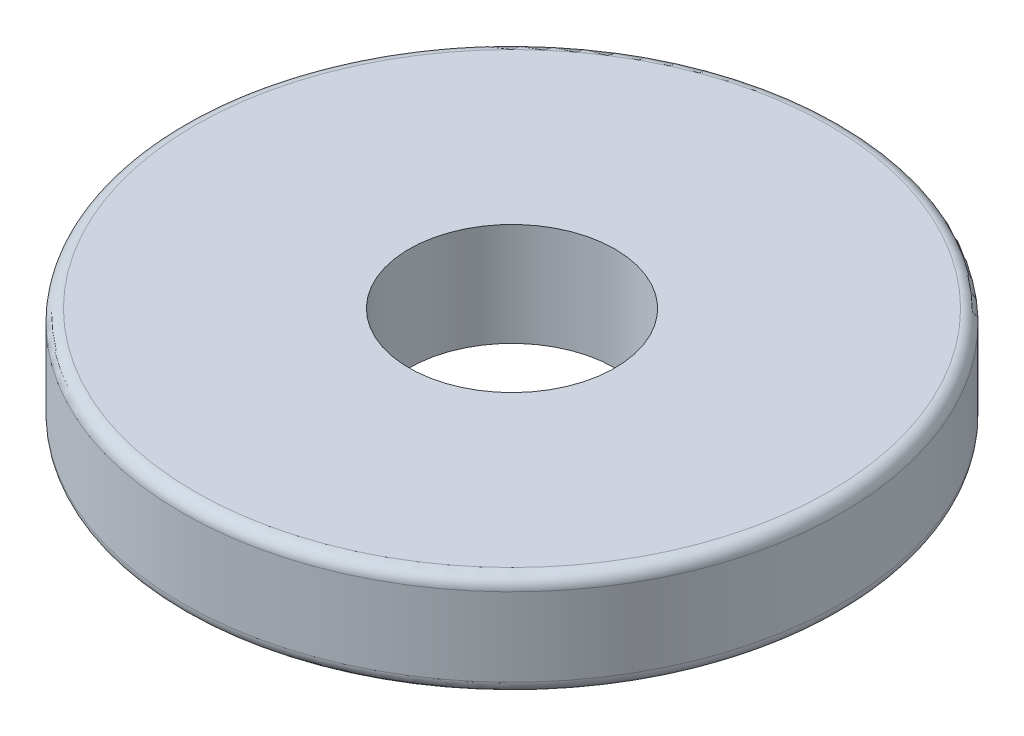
ISO-10303-21;
HEADER;
FILE_DESCRIPTION(('STEP AP214'),'2;1');
FILE_NAME('part.step','',(''),(''),'','','');
FILE_SCHEMA(('AUTOMOTIVE_DESIGN { 1 0 10303 214 1 1 1 1 }'));
ENDSEC;
DATA;
#1=APPLICATION_CONTEXT('core data for automotive mechanical design processes');
#2=APPLICATION_PROTOCOL_DEFINITION('international standard','automotive_design',2000,#1);
#3=PRODUCT_CONTEXT('',#1,'mechanical');
#4=PRODUCT('Part','Part','',(#3));
#5=PRODUCT_RELATED_PRODUCT_CATEGORY('part','',(#4));
#6=PRODUCT_DEFINITION_FORMATION('','',#4);
#7=PRODUCT_DEFINITION_CONTEXT('part definition',#1,'design');
#8=PRODUCT_DEFINITION('design','',#6,#7);
#9=PRODUCT_DEFINITION_SHAPE('','',#8);
#10=(LENGTH_UNIT() NAMED_UNIT(*) SI_UNIT(.MILLI.,.METRE.));
#11=(NAMED_UNIT(*) PLANE_ANGLE_UNIT() SI_UNIT($,.RADIAN.));
#12=(NAMED_UNIT(*) SI_UNIT($,.STERADIAN.) SOLID_ANGLE_UNIT());
#13=UNCERTAINTY_MEASURE_WITH_UNIT(LENGTH_MEASURE(1.E-05),#10,'distance_accuracy_value','');
#14=(GEOMETRIC_REPRESENTATION_CONTEXT(3) GLOBAL_UNCERTAINTY_ASSIGNED_CONTEXT((#13)) GLOBAL_UNIT_ASSIGNED_CONTEXT((#10,
#11,#12)) REPRESENTATION_CONTEXT('',''));
#15=CARTESIAN_POINT('',(0.,0.,0.));
#16=DIRECTION('',(0.,0.,1.));
#17=DIRECTION('',(1.,0.,0.));
#18=AXIS2_PLACEMENT_3D('',#15,#16,#17);
#19=CARTESIAN_POINT('',(0.,0.,0.));
#20=DIRECTION('',(0.,-1.,0.));
#21=DIRECTION('',(0.,0.,-1.));
#22=AXIS2_PLACEMENT_3D('',#19,#20,#21);
#23=CYLINDRICAL_SURFACE('',#22,2.5);
#24=CARTESIAN_POINT('',(0.,1.,0.));
#25=DIRECTION('',(0.,-1.,0.));
#26=DIRECTION('',(0.,0.,-1.));
#27=AXIS2_PLACEMENT_3D('',#24,#25,#26);
#28=CIRCLE('',#27,2.5);
#29=CARTESIAN_POINT('',(0.,1.,-2.5));
#30=VERTEX_POINT('',#29);
#31=EDGE_CURVE('E52',#30,#30,#28,.T.);
#32=ORIENTED_EDGE('',*,*,#31,.T.);
#33=EDGE_LOOP('',(#32));
#34=FACE_BOUND('',#33,.T.);
#35=CARTESIAN_POINT('',(0.,3.5,0.));
#36=DIRECTION('',(0.,-1.,0.));
#37=DIRECTION('',(0.,0.,-1.));
#38=AXIS2_PLACEMENT_3D('',#35,#36,#37);
#39=CIRCLE('',#38,2.5);
#40=CARTESIAN_POINT('',(0.,3.5,-2.5));
#41=VERTEX_POINT('',#40);
#42=EDGE_CURVE('E49',#41,#41,#39,.T.);
#43=ORIENTED_EDGE('',*,*,#42,.F.);
#44=EDGE_LOOP('',(#43));
#45=FACE_BOUND('',#44,.T.);
#46=ADVANCED_FACE('F29',(#34,#45),#23,.F.);
#47=CARTESIAN_POINT('',(2.5,3.5,0.));
#48=DIRECTION('',(0.,1.,0.));
#49=DIRECTION('',(0.,0.,1.));
#50=AXIS2_PLACEMENT_3D('',#47,#48,#49);
#51=PLANE('',#50);
#52=CARTESIAN_POINT('',(0.,3.5,0.));
#53=DIRECTION('',(0.,1.,0.));
#54=DIRECTION('',(0.,0.,1.));
#55=AXIS2_PLACEMENT_3D('',#52,#53,#54);
#56=CIRCLE('',#55,7.7);
#57=CARTESIAN_POINT('',(0.,3.5,7.7));
#58=VERTEX_POINT('',#57);
#59=EDGE_CURVE('E10',#58,#58,#56,.T.);
#60=ORIENTED_EDGE('',*,*,#59,.T.);
#61=EDGE_LOOP('',(#60));
#62=FACE_BOUND('',#61,.T.);
#63=ORIENTED_EDGE('',*,*,#42,.T.);
#64=EDGE_LOOP('',(#63));
#65=FACE_BOUND('',#64,.T.);
#66=ADVANCED_FACE('F69',(#62,#65),#51,.T.);
#67=CARTESIAN_POINT('',(0.,0.,0.));
#68=DIRECTION('',(0.,-1.,0.));
#69=DIRECTION('',(0.,0.,-1.));
#70=AXIS2_PLACEMENT_3D('',#67,#68,#69);
#71=CYLINDRICAL_SURFACE('',#70,8.);
#72=CARTESIAN_POINT('',(0.,1.3,0.));
#73=DIRECTION('',(0.,-1.,0.));
#74=DIRECTION('',(0.,0.,-1.));
#75=AXIS2_PLACEMENT_3D('',#72,#73,#74);
#76=CIRCLE('',#75,8.);
#77=CARTESIAN_POINT('',(0.,1.3,-8.));
#78=VERTEX_POINT('',#77);
#79=EDGE_CURVE('E36',#78,#78,#76,.F.);
#80=ORIENTED_EDGE('',*,*,#79,.T.);
#81=EDGE_LOOP('',(#80));
#82=FACE_BOUND('',#81,.T.);
#83=CARTESIAN_POINT('',(0.,3.2,0.));
#84=DIRECTION('',(0.,1.,0.));
#85=DIRECTION('',(0.,0.,1.));
#86=AXIS2_PLACEMENT_3D('',#83,#84,#85);
#87=CIRCLE('',#86,8.);
#88=CARTESIAN_POINT('',(0.,3.2,8.));
#89=VERTEX_POINT('',#88);
#90=EDGE_CURVE('E40',#89,#89,#87,.F.);
#91=ORIENTED_EDGE('',*,*,#90,.T.);
#92=EDGE_LOOP('',(#91));
#93=FACE_BOUND('',#92,.T.);
#94=ADVANCED_FACE('F61',(#82,#93),#71,.T.);
#95=CARTESIAN_POINT('',(2.5,1.,0.));
#96=DIRECTION('',(0.,-1.,0.));
#97=DIRECTION('',(0.,0.,-1.));
#98=AXIS2_PLACEMENT_3D('',#95,#96,#97);
#99=PLANE('',#98);
#100=CARTESIAN_POINT('',(0.,1.,0.));
#101=DIRECTION('',(0.,-1.,0.));
#102=DIRECTION('',(0.,0.,-1.));
#103=AXIS2_PLACEMENT_3D('',#100,#101,#102);
#104=CIRCLE('',#103,7.7);
#105=CARTESIAN_POINT('',(0.,1.,-7.7));
#106=VERTEX_POINT('',#105);
#107=EDGE_CURVE('E44',#106,#106,#104,.T.);
#108=ORIENTED_EDGE('',*,*,#107,.T.);
#109=EDGE_LOOP('',(#108));
#110=FACE_BOUND('',#109,.T.);
#111=ORIENTED_EDGE('',*,*,#31,.F.);
#112=EDGE_LOOP('',(#111));
#113=FACE_BOUND('',#112,.T.);
#114=ADVANCED_FACE('F58',(#110,#113),#99,.T.);
#115=CARTESIAN_POINT('',(0.,1.3,0.));
#116=DIRECTION('',(0.,-1.,0.));
#117=DIRECTION('',(0.,0.,-1.));
#118=AXIS2_PLACEMENT_3D('',#115,#116,#117);
#119=TOROIDAL_SURFACE('',#118,7.7,0.3);
#120=ORIENTED_EDGE('',*,*,#79,.F.);
#121=EDGE_LOOP('',(#120));
#122=FACE_BOUND('',#121,.T.);
#123=ORIENTED_EDGE('',*,*,#107,.F.);
#124=EDGE_LOOP('',(#123));
#125=FACE_BOUND('',#124,.T.);
#126=ADVANCED_FACE('F60',(#122,#125),#119,.T.);
#127=CARTESIAN_POINT('',(0.,3.2,0.));
#128=DIRECTION('',(0.,1.,0.));
#129=DIRECTION('',(0.,0.,1.));
#130=AXIS2_PLACEMENT_3D('',#127,#128,#129);
#131=TOROIDAL_SURFACE('',#130,7.7,0.3);
#132=ORIENTED_EDGE('',*,*,#59,.F.);
#133=EDGE_LOOP('',(#132));
#134=FACE_BOUND('',#133,.T.);
#135=ORIENTED_EDGE('',*,*,#90,.F.);
#136=EDGE_LOOP('',(#135));
#137=FACE_BOUND('',#136,.T.);
#138=ADVANCED_FACE('F31',(#134,#137),#131,.T.);
#139=CLOSED_SHELL('',(#46,#66,#94,#114,#126,#138));
#140=MANIFOLD_SOLID_BREP('B2',#139);
#141=ADVANCED_BREP_SHAPE_REPRESENTATION('',(#18,#140),#14);
#142=SHAPE_DEFINITION_REPRESENTATION(#9,#141);
ENDSEC;
END-ISO-10303-21;
